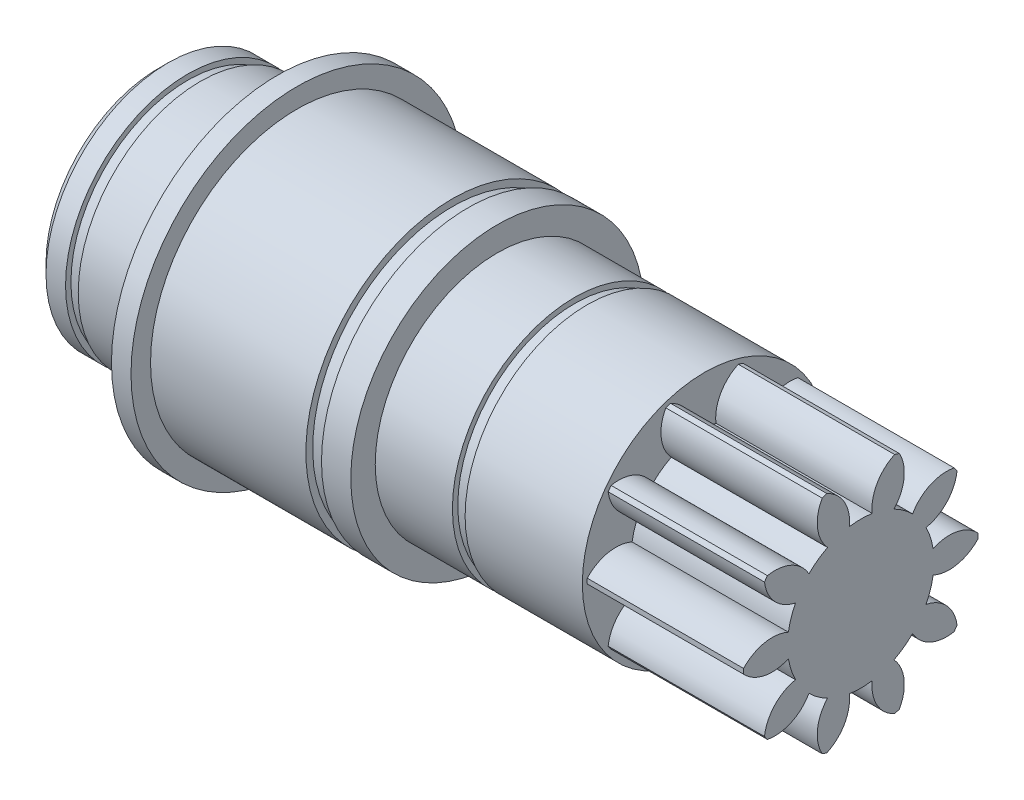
from build123d import *

# Parameters (mm, degrees)
BASPROSKE_W             = 16
BASPROSKE_H             = 12
TOOTHCUT_DEPTH          = 24.323807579
TEETHCUTS_COUNT         = 10
TEETHCUTS_ANGLE         = 324
BORSKE_R                = 7.4736
BORE_DEPTH              = 50.0000508
EXTRUSION2_START        = -16
ESQUISSE1_R             = 7.499
EXTRUSION2_DEPTH        = 16
ESQUISSE2_R             = 12.5
EXTRUSION3_DEPTH        = 12
ESQUISSE3_R             = 11.95
EXTRUSION4_DEPTH        = 1.3
ESQUISSE4_R             = 12.5
EXTRUSION5_DEPTH        = 7.9
ESQUISSE5_R             = 15
EXTRUSION6_DEPTH        = 3
ESQUISSE6_R             = 14.3
EXTRUSION7_DEPTH        = 1.6
ESQUISSE7_R             = 15
EXTRUSION8_DEPTH        = 15.9
ESQUISSE8_R             = 17
EXTRUSION9_DEPTH        = 2
ESQUISSE9_R             = 12.5
EXTRUSION11_DEPTH       = 7.9
ESQUISSE10_R            = 11.95
EXTRUSION12_DEPTH       = 1.3
ESQUISSE11_R            = 12.5
EXTRUSION13_DEPTH       = 3
CHANFREIN1_SIZE         = 1
ENL_V_MAT_EXTRU_1_DEPTH = 15


with BuildPart() as part:
    # BasProSke → Base-Revolve (revolve)
    with BuildSketch(Plane(origin=(0, 0, 0), x_dir=(1, 0, 0), z_dir=(0, 1, 0)), mode=Mode.PRIVATE) as base_revolve_sk:
        with Locations((8, 6)):
            Rectangle(BASPROSKE_W, BASPROSKE_H)
    revolve(base_revolve_sk.sketch.rotate(Axis((-10, 0, 0), (1, 0, 0)), 180), axis=Axis((-10, 0, 0), (1, 0, 0)))

    # TooCutSke → ToothCut (cut, through all)
    with BuildSketch(Plane(origin=(0, 0, 0), x_dir=(0, 0, -1), z_dir=(1, 0, 0))):
        with BuildLine():
            ThreePointArc((1.173662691, 7.406586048), (0, 7.499), (-1.173662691, 7.406586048))
            ThreePointArc((-1.173662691, 7.406586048), (-1.668191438, 9.834565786), (-3.497907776, 11.50542856))
            ThreePointArc((-3.497907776, 11.50542856), (0, 12.0254), (3.497907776, 11.50542856))
            ThreePointArc((3.497907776, 11.50542856), (1.668191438, 9.834565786), (1.173662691, 7.406586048))
        make_face()
    toothcut = extrude(amount=TOOTHCUT_DEPTH, mode=Mode.SUBTRACT)

    # TeethCuts: ToothCut ×10 about axis
    teethcuts_axis = Axis((-10, 0, 0), (1, 0, 0))
    for i in range(1, TEETHCUTS_COUNT):
        add(toothcut.rotate(teethcuts_axis, i * TEETHCUTS_ANGLE / (TEETHCUTS_COUNT - 1)), mode=Mode.SUBTRACT)

    # BorSke → Bore (cut, symmetric)
    with BuildSketch(Plane(origin=(0, 0, 0), x_dir=(0, 0, -1), z_dir=(1, 0, 0))):
        with Locations(Location((0, 0, 0), (0, 0, 180))):
            Circle(BORSKE_R)
    extrude(amount=BORE_DEPTH, both=True, mode=Mode.SUBTRACT)

    # Esquisse1 → Extrusion2 (add)
    with BuildSketch(Plane(origin=(16, 0, 0), x_dir=(0, 0, -1), z_dir=(1, 0, 0)).offset(EXTRUSION2_START)):
        Circle(ESQUISSE1_R)
    extrude(amount=EXTRUSION2_DEPTH)

    # Esquisse2 → Extrusion3 (add)
    with BuildSketch(Plane.ZY):
        Circle(ESQUISSE2_R)
    extrude(amount=EXTRUSION3_DEPTH)

    # Esquisse3 → Extrusion4 (add)
    with BuildSketch(Plane.ZY.offset(12)):
        Circle(ESQUISSE3_R)
    extrude(amount=EXTRUSION4_DEPTH)

    # Esquisse4 → Extrusion5 (add)
    with BuildSketch(Plane.ZY.offset(13.3)):
        Circle(ESQUISSE4_R)
    extrude(amount=EXTRUSION5_DEPTH)

    # Esquisse5 → Extrusion6 (add)
    with BuildSketch(Plane.ZY.offset(21.2)):
        Circle(ESQUISSE5_R)
    extrude(amount=EXTRUSION6_DEPTH)

    # Esquisse6 → Extrusion7 (add)
    with BuildSketch(Plane.ZY.offset(24.2)):
        Circle(ESQUISSE6_R)
    extrude(amount=EXTRUSION7_DEPTH)

    # Esquisse7 → Extrusion8 (add)
    with BuildSketch(Plane.ZY.offset(25.8)):
        Circle(ESQUISSE7_R)
    extrude(amount=EXTRUSION8_DEPTH)

    # Esquisse8 → Extrusion9 (add)
    with BuildSketch(Plane.ZY.offset(41.7)):
        Circle(ESQUISSE8_R)
    extrude(amount=EXTRUSION9_DEPTH)

    # Esquisse9 → Extrusion11 (add)
    with BuildSketch(Plane.ZY.offset(43.7)):
        Circle(ESQUISSE9_R)
    extrude(amount=EXTRUSION11_DEPTH)

    # Esquisse10 → Extrusion12 (add)
    with BuildSketch(Plane.ZY.offset(51.6)):
        Circle(ESQUISSE10_R)
    extrude(amount=EXTRUSION12_DEPTH)

    # Esquisse11 → Extrusion13 (add)
    with BuildSketch(Plane.ZY.offset(52.9)):
        Circle(ESQUISSE11_R)
    extrude(amount=EXTRUSION13_DEPTH)

    # Chanfrein1
    chanfrein1_edges = [part.edges().sort_by_distance(p)[0] for p in [
        (-55.9, 0, -12.5),
    ]]
    chamfer(chanfrein1_edges, length=CHANFREIN1_SIZE)

    # Esquisse12 → Enl_v. mat.-Extru.1 (cut)
    with BuildSketch(Plane(origin=(-25.8, 0, 0), x_dir=(0, 0, -1), z_dir=(1, 0, 0))):
        Polygon((-1.308311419, -18.350371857), (-8.973452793, -16.060042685), (-6.969414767, -9.353043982), (0.695726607, -11.643373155), align=None)
    extrude(amount=-ENL_V_MAT_EXTRU_1_DEPTH, mode=Mode.SUBTRACT)


solid = part.part
